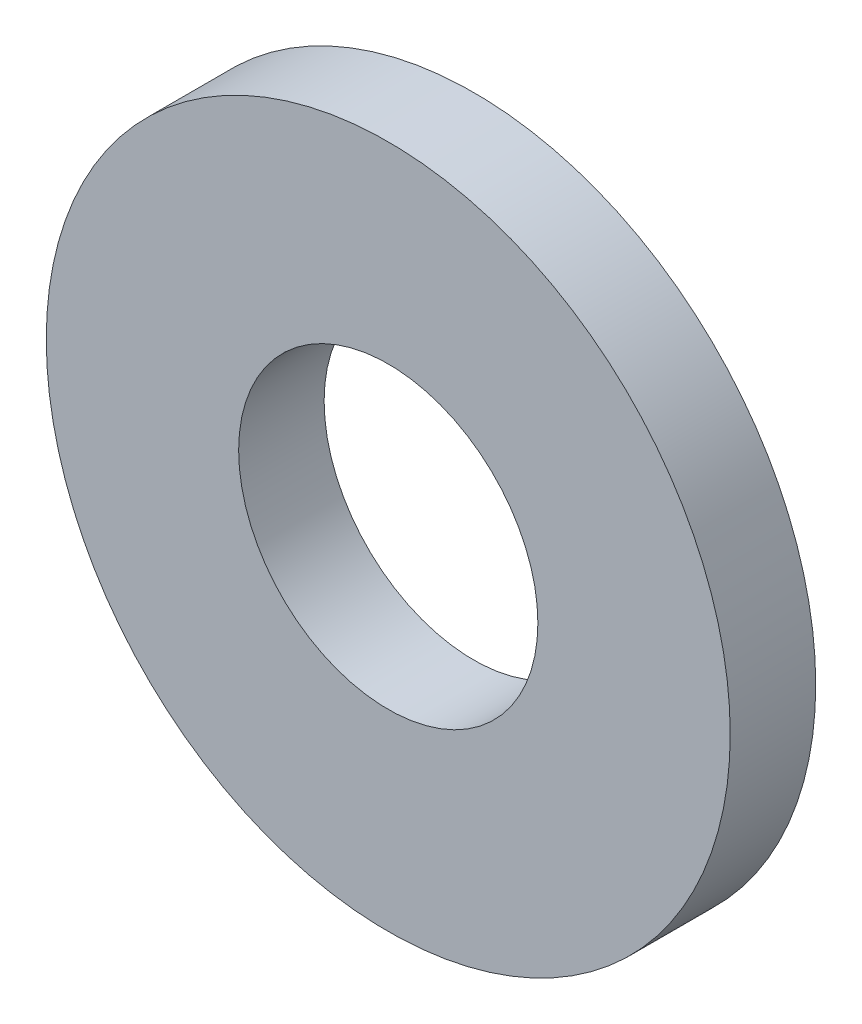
ISO-10303-21;
HEADER;
FILE_DESCRIPTION(('STEP AP214'),'2;1');
FILE_NAME('part.step','',(''),(''),'','','');
FILE_SCHEMA(('AUTOMOTIVE_DESIGN { 1 0 10303 214 1 1 1 1 }'));
ENDSEC;
DATA;
#1=APPLICATION_CONTEXT('core data for automotive mechanical design processes');
#2=APPLICATION_PROTOCOL_DEFINITION('international standard','automotive_design',2000,#1);
#3=PRODUCT_CONTEXT('',#1,'mechanical');
#4=PRODUCT('Part','Part','',(#3));
#5=PRODUCT_RELATED_PRODUCT_CATEGORY('part','',(#4));
#6=PRODUCT_DEFINITION_FORMATION('','',#4);
#7=PRODUCT_DEFINITION_CONTEXT('part definition',#1,'design');
#8=PRODUCT_DEFINITION('design','',#6,#7);
#9=PRODUCT_DEFINITION_SHAPE('','',#8);
#10=(LENGTH_UNIT() NAMED_UNIT(*) SI_UNIT(.MILLI.,.METRE.));
#11=(NAMED_UNIT(*) PLANE_ANGLE_UNIT() SI_UNIT($,.RADIAN.));
#12=(NAMED_UNIT(*) SI_UNIT($,.STERADIAN.) SOLID_ANGLE_UNIT());
#13=UNCERTAINTY_MEASURE_WITH_UNIT(LENGTH_MEASURE(1.E-05),#10,'distance_accuracy_value','');
#14=(GEOMETRIC_REPRESENTATION_CONTEXT(3) GLOBAL_UNCERTAINTY_ASSIGNED_CONTEXT((#13)) GLOBAL_UNIT_ASSIGNED_CONTEXT((#10,
#11,#12)) REPRESENTATION_CONTEXT('',''));
#15=CARTESIAN_POINT('',(0.,0.,0.));
#16=DIRECTION('',(0.,0.,1.));
#17=DIRECTION('',(1.,0.,0.));
#18=AXIS2_PLACEMENT_3D('',#15,#16,#17);
#19=CARTESIAN_POINT('',(0.,0.,1.));
#20=DIRECTION('',(0.,0.,1.));
#21=DIRECTION('',(1.,0.,0.));
#22=AXIS2_PLACEMENT_3D('',#19,#20,#21);
#23=PLANE('',#22);
#24=CARTESIAN_POINT('',(0.,0.,1.));
#25=DIRECTION('',(0.,0.,1.));
#26=DIRECTION('',(1.,0.,0.));
#27=AXIS2_PLACEMENT_3D('',#24,#25,#26);
#28=CIRCLE('',#27,4.);
#29=CARTESIAN_POINT('',(4.,0.,1.));
#30=VERTEX_POINT('',#29);
#31=EDGE_CURVE('E10',#30,#30,#28,.T.);
#32=ORIENTED_EDGE('',*,*,#31,.T.);
#33=EDGE_LOOP('',(#32));
#34=FACE_BOUND('',#33,.T.);
#35=CARTESIAN_POINT('',(0.,0.,1.));
#36=DIRECTION('',(0.,0.,1.));
#37=DIRECTION('',(1.,0.,0.));
#38=AXIS2_PLACEMENT_3D('',#35,#36,#37);
#39=CIRCLE('',#38,1.75);
#40=CARTESIAN_POINT('',(1.75,0.,1.));
#41=VERTEX_POINT('',#40);
#42=EDGE_CURVE('E50',#41,#41,#39,.T.);
#43=ORIENTED_EDGE('',*,*,#42,.F.);
#44=EDGE_LOOP('',(#43));
#45=FACE_BOUND('',#44,.T.);
#46=ADVANCED_FACE('F37',(#34,#45),#23,.T.);
#47=CARTESIAN_POINT('',(0.,0.,0.));
#48=DIRECTION('',(0.,0.,1.));
#49=DIRECTION('',(1.,0.,0.));
#50=AXIS2_PLACEMENT_3D('',#47,#48,#49);
#51=PLANE('',#50);
#52=CARTESIAN_POINT('',(0.,0.,0.));
#53=DIRECTION('',(0.,0.,1.));
#54=DIRECTION('',(1.,0.,0.));
#55=AXIS2_PLACEMENT_3D('',#52,#53,#54);
#56=CIRCLE('',#55,4.);
#57=CARTESIAN_POINT('',(4.,0.,0.));
#58=VERTEX_POINT('',#57);
#59=EDGE_CURVE('E41',#58,#58,#56,.T.);
#60=ORIENTED_EDGE('',*,*,#59,.F.);
#61=EDGE_LOOP('',(#60));
#62=FACE_BOUND('',#61,.T.);
#63=CARTESIAN_POINT('',(0.,0.,0.));
#64=DIRECTION('',(0.,0.,1.));
#65=DIRECTION('',(1.,0.,0.));
#66=AXIS2_PLACEMENT_3D('',#63,#64,#65);
#67=CIRCLE('',#66,1.75);
#68=CARTESIAN_POINT('',(1.75,0.,0.));
#69=VERTEX_POINT('',#68);
#70=EDGE_CURVE('E52',#69,#69,#67,.T.);
#71=ORIENTED_EDGE('',*,*,#70,.T.);
#72=EDGE_LOOP('',(#71));
#73=FACE_BOUND('',#72,.T.);
#74=ADVANCED_FACE('F64',(#62,#73),#51,.F.);
#75=CARTESIAN_POINT('',(0.,0.,1.));
#76=DIRECTION('',(0.,0.,-1.));
#77=DIRECTION('',(-1.,0.,0.));
#78=AXIS2_PLACEMENT_3D('',#75,#76,#77);
#79=CYLINDRICAL_SURFACE('',#78,4.);
#80=ORIENTED_EDGE('',*,*,#31,.F.);
#81=EDGE_LOOP('',(#80));
#82=FACE_BOUND('',#81,.T.);
#83=ORIENTED_EDGE('',*,*,#59,.T.);
#84=EDGE_LOOP('',(#83));
#85=FACE_BOUND('',#84,.T.);
#86=ADVANCED_FACE('F39',(#82,#85),#79,.T.);
#87=CARTESIAN_POINT('',(0.,0.,1.));
#88=DIRECTION('',(0.,0.,-1.));
#89=DIRECTION('',(-1.,0.,0.));
#90=AXIS2_PLACEMENT_3D('',#87,#88,#89);
#91=CYLINDRICAL_SURFACE('',#90,1.75);
#92=ORIENTED_EDGE('',*,*,#42,.T.);
#93=EDGE_LOOP('',(#92));
#94=FACE_BOUND('',#93,.T.);
#95=ORIENTED_EDGE('',*,*,#70,.F.);
#96=EDGE_LOOP('',(#95));
#97=FACE_BOUND('',#96,.T.);
#98=ADVANCED_FACE('F60',(#94,#97),#91,.F.);
#99=CLOSED_SHELL('',(#46,#74,#86,#98));
#100=MANIFOLD_SOLID_BREP('B2',#99);
#101=ADVANCED_BREP_SHAPE_REPRESENTATION('',(#18,#100),#14);
#102=SHAPE_DEFINITION_REPRESENTATION(#9,#101);
ENDSEC;
END-ISO-10303-21;
